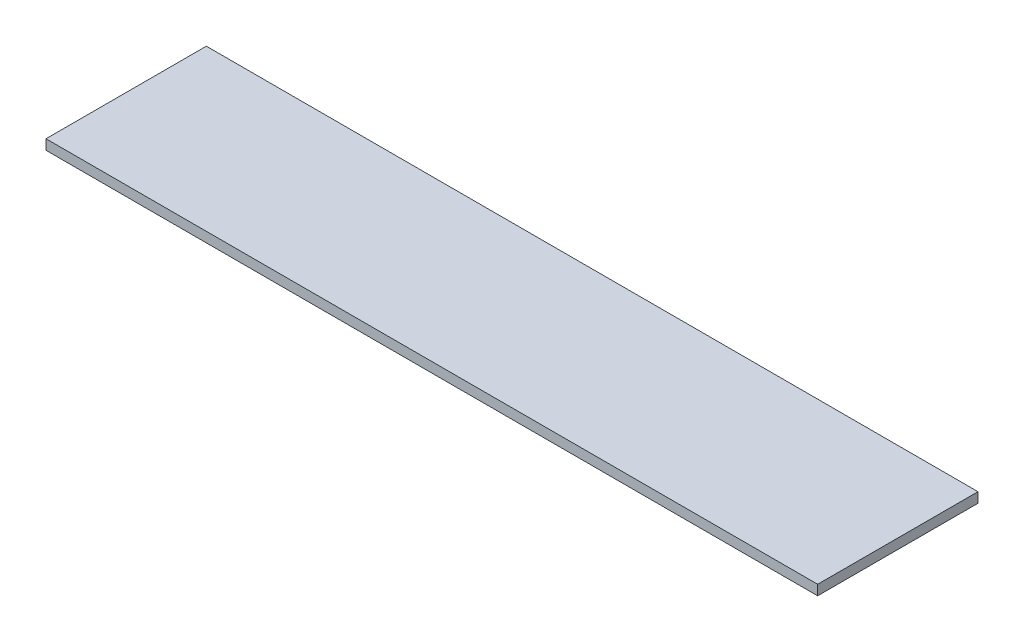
from build123d import *

# Parameters (mm, degrees)
ESQUISSE1_W        = 1540
ESQUISSE1_H        = 320
BOSS_EXTRU_1_DEPTH = 10


with BuildPart() as part:
    # Esquisse1 → Boss.-Extru.1 (new, symmetric)
    with BuildSketch(Plane(origin=(0, 0, 0), x_dir=(1, 0, 0), z_dir=(0, 1, 0))):
        Rectangle(ESQUISSE1_W, ESQUISSE1_H)
    extrude(amount=BOSS_EXTRU_1_DEPTH, both=True)


solid = part.part
